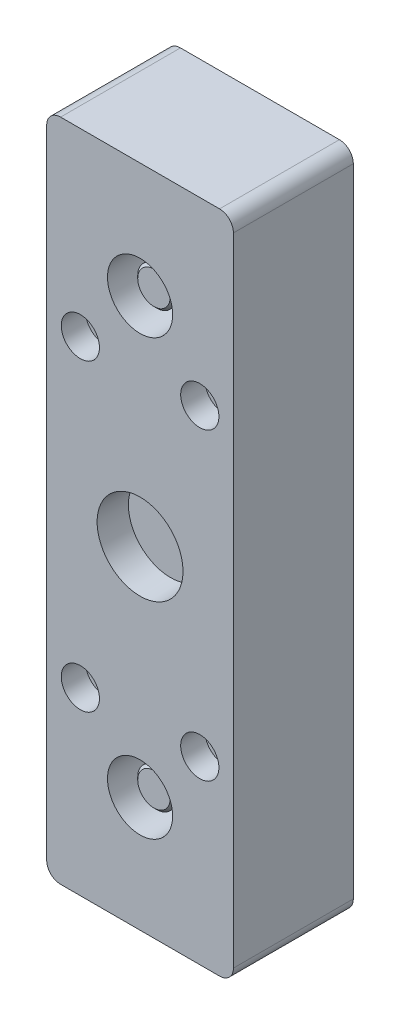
ISO-10303-21;
HEADER;
FILE_DESCRIPTION(('STEP AP214'),'2;1');
FILE_NAME('part.step','',(''),(''),'','','');
FILE_SCHEMA(('AUTOMOTIVE_DESIGN { 1 0 10303 214 1 1 1 1 }'));
ENDSEC;
DATA;
#1=APPLICATION_CONTEXT('core data for automotive mechanical design processes');
#2=APPLICATION_PROTOCOL_DEFINITION('international standard','automotive_design',2000,#1);
#3=PRODUCT_CONTEXT('',#1,'mechanical');
#4=PRODUCT('Part','Part','',(#3));
#5=PRODUCT_RELATED_PRODUCT_CATEGORY('part','',(#4));
#6=PRODUCT_DEFINITION_FORMATION('','',#4);
#7=PRODUCT_DEFINITION_CONTEXT('part definition',#1,'design');
#8=PRODUCT_DEFINITION('design','',#6,#7);
#9=PRODUCT_DEFINITION_SHAPE('','',#8);
#10=(LENGTH_UNIT() NAMED_UNIT(*) SI_UNIT(.MILLI.,.METRE.));
#11=(NAMED_UNIT(*) PLANE_ANGLE_UNIT() SI_UNIT($,.RADIAN.));
#12=(NAMED_UNIT(*) SI_UNIT($,.STERADIAN.) SOLID_ANGLE_UNIT());
#13=UNCERTAINTY_MEASURE_WITH_UNIT(LENGTH_MEASURE(1.E-05),#10,'distance_accuracy_value','');
#14=(GEOMETRIC_REPRESENTATION_CONTEXT(3) GLOBAL_UNCERTAINTY_ASSIGNED_CONTEXT((#13)) GLOBAL_UNIT_ASSIGNED_CONTEXT((#10,
#11,#12)) REPRESENTATION_CONTEXT('',''));
#15=CARTESIAN_POINT('',(0.,0.,0.));
#16=DIRECTION('',(0.,0.,1.));
#17=DIRECTION('',(1.,0.,0.));
#18=AXIS2_PLACEMENT_3D('',#15,#16,#17);
#19=CARTESIAN_POINT('',(1.73205080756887,66.5,-11.7715));
#20=DIRECTION('',(0.,0.,-1.));
#21=DIRECTION('',(-1.,0.,0.));
#22=AXIS2_PLACEMENT_3D('',#19,#20,#21);
#23=PLANE('',#22);
#24=DIRECTION('',(1.,0.,0.));
#25=VECTOR('',#24,1.);
#26=CARTESIAN_POINT('',(-1.73205080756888,66.5,-11.7715));
#27=LINE('',#26,#25);
#28=CARTESIAN_POINT('',(-1.73205080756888,66.5,-11.7715));
#29=VERTEX_POINT('',#28);
#30=CARTESIAN_POINT('',(1.73205080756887,66.5,-11.7715));
#31=VERTEX_POINT('',#30);
#32=EDGE_CURVE('E1108',#29,#31,#27,.T.);
#33=ORIENTED_EDGE('',*,*,#32,.T.);
#34=DIRECTION('',(0.5,-0.866025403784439,0.));
#35=VECTOR('',#34,1.);
#36=CARTESIAN_POINT('',(1.73205080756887,66.5,-11.7715));
#37=LINE('',#36,#35);
#38=CARTESIAN_POINT('',(3.46410161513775,63.5,-11.7715));
#39=VERTEX_POINT('',#38);
#40=EDGE_CURVE('E1112',#31,#39,#37,.T.);
#41=ORIENTED_EDGE('',*,*,#40,.T.);
#42=DIRECTION('',(-0.5,-0.866025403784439,0.));
#43=VECTOR('',#42,1.);
#44=CARTESIAN_POINT('',(3.46410161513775,63.5,-11.7715));
#45=LINE('',#44,#43);
#46=CARTESIAN_POINT('',(1.73205080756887,60.5,-11.7715));
#47=VERTEX_POINT('',#46);
#48=EDGE_CURVE('E1119',#39,#47,#45,.T.);
#49=ORIENTED_EDGE('',*,*,#48,.T.);
#50=DIRECTION('',(-1.,0.,0.));
#51=VECTOR('',#50,1.);
#52=CARTESIAN_POINT('',(1.73205080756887,60.5,-11.7715));
#53=LINE('',#52,#51);
#54=CARTESIAN_POINT('',(-1.73205080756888,60.5,-11.7715));
#55=VERTEX_POINT('',#54);
#56=EDGE_CURVE('E1126',#47,#55,#53,.T.);
#57=ORIENTED_EDGE('',*,*,#56,.T.);
#58=DIRECTION('',(-0.5,0.866025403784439,0.));
#59=VECTOR('',#58,1.);
#60=CARTESIAN_POINT('',(-1.73205080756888,60.5,-11.7715));
#61=LINE('',#60,#59);
#62=CARTESIAN_POINT('',(-3.46410161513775,63.5,-11.7715));
#63=VERTEX_POINT('',#62);
#64=EDGE_CURVE('E1129',#55,#63,#61,.T.);
#65=ORIENTED_EDGE('',*,*,#64,.T.);
#66=DIRECTION('',(0.5,0.866025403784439,0.));
#67=VECTOR('',#66,1.);
#68=CARTESIAN_POINT('',(-3.46410161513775,63.5,-11.7715));
#69=LINE('',#68,#67);
#70=EDGE_CURVE('E1115',#63,#29,#69,.T.);
#71=ORIENTED_EDGE('',*,*,#70,.T.);
#72=EDGE_LOOP('',(#33,#41,#49,#57,#65,#71));
#73=FACE_BOUND('',#72,.T.);
#74=ADVANCED_FACE('F16',(#73),#23,.T.);
#75=CARTESIAN_POINT('',(3.46410161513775,63.5,-11.7715));
#76=DIRECTION('',(0.866025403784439,-0.5,0.));
#77=DIRECTION('',(-0.5,-0.866025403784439,0.));
#78=AXIS2_PLACEMENT_3D('',#75,#76,#77);
#79=PLANE('',#78);
#80=DIRECTION('',(-0.5,-0.866025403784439,0.));
#81=VECTOR('',#80,1.);
#82=CARTESIAN_POINT('',(3.46410161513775,63.5,-16.534));
#83=LINE('',#82,#81);
#84=CARTESIAN_POINT('',(3.46410161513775,63.5,-16.534));
#85=VERTEX_POINT('',#84);
#86=CARTESIAN_POINT('',(1.73205080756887,60.5,-16.534));
#87=VERTEX_POINT('',#86);
#88=EDGE_CURVE('E1137',#85,#87,#83,.T.);
#89=ORIENTED_EDGE('',*,*,#88,.T.);
#90=DIRECTION('',(0.,0.,-1.));
#91=VECTOR('',#90,1.);
#92=CARTESIAN_POINT('',(1.73205080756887,60.5,-11.7715));
#93=LINE('',#92,#91);
#94=EDGE_CURVE('E1154',#47,#87,#93,.T.);
#95=ORIENTED_EDGE('',*,*,#94,.F.);
#96=ORIENTED_EDGE('',*,*,#48,.F.);
#97=DIRECTION('',(0.,0.,-1.));
#98=VECTOR('',#97,1.);
#99=CARTESIAN_POINT('',(3.46410161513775,63.5,-11.7715));
#100=LINE('',#99,#98);
#101=EDGE_CURVE('E1157',#39,#85,#100,.T.);
#102=ORIENTED_EDGE('',*,*,#101,.T.);
#103=EDGE_LOOP('',(#89,#95,#96,#102));
#104=FACE_BOUND('',#103,.T.);
#105=ADVANCED_FACE('F986',(#104),#79,.F.);
#106=CARTESIAN_POINT('',(1.73205080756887,60.5,-11.7715));
#107=DIRECTION('',(0.,-1.,0.));
#108=DIRECTION('',(-1.,0.,0.));
#109=AXIS2_PLACEMENT_3D('',#106,#107,#108);
#110=PLANE('',#109);
#111=DIRECTION('',(-1.,0.,0.));
#112=VECTOR('',#111,1.);
#113=CARTESIAN_POINT('',(1.73205080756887,60.5,-16.534));
#114=LINE('',#113,#112);
#115=CARTESIAN_POINT('',(-1.73205080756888,60.5,-16.534));
#116=VERTEX_POINT('',#115);
#117=EDGE_CURVE('E1140',#87,#116,#114,.T.);
#118=ORIENTED_EDGE('',*,*,#117,.T.);
#119=DIRECTION('',(0.,0.,-1.));
#120=VECTOR('',#119,1.);
#121=CARTESIAN_POINT('',(-1.73205080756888,60.5,-11.7715));
#122=LINE('',#121,#120);
#123=EDGE_CURVE('E1151',#55,#116,#122,.T.);
#124=ORIENTED_EDGE('',*,*,#123,.F.);
#125=ORIENTED_EDGE('',*,*,#56,.F.);
#126=ORIENTED_EDGE('',*,*,#94,.T.);
#127=EDGE_LOOP('',(#118,#124,#125,#126));
#128=FACE_BOUND('',#127,.T.);
#129=ADVANCED_FACE('F975',(#128),#110,.F.);
#130=CARTESIAN_POINT('',(-1.73205080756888,60.5,-11.7715));
#131=DIRECTION('',(-0.866025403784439,-0.5,0.));
#132=DIRECTION('',(-0.5,0.866025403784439,0.));
#133=AXIS2_PLACEMENT_3D('',#130,#131,#132);
#134=PLANE('',#133);
#135=DIRECTION('',(-0.5,0.866025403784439,0.));
#136=VECTOR('',#135,1.);
#137=CARTESIAN_POINT('',(-1.73205080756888,60.5,-16.534));
#138=LINE('',#137,#136);
#139=CARTESIAN_POINT('',(-3.46410161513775,63.5,-16.534));
#140=VERTEX_POINT('',#139);
#141=EDGE_CURVE('E1122',#116,#140,#138,.T.);
#142=ORIENTED_EDGE('',*,*,#141,.T.);
#143=DIRECTION('',(0.,0.,-1.));
#144=VECTOR('',#143,1.);
#145=CARTESIAN_POINT('',(-3.46410161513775,63.5,-11.7715));
#146=LINE('',#145,#144);
#147=EDGE_CURVE('E1148',#63,#140,#146,.T.);
#148=ORIENTED_EDGE('',*,*,#147,.F.);
#149=ORIENTED_EDGE('',*,*,#64,.F.);
#150=ORIENTED_EDGE('',*,*,#123,.T.);
#151=EDGE_LOOP('',(#142,#148,#149,#150));
#152=FACE_BOUND('',#151,.T.);
#153=ADVANCED_FACE('F964',(#152),#134,.F.);
#154=CARTESIAN_POINT('',(-3.46410161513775,63.5,-11.7715));
#155=DIRECTION('',(-0.866025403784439,0.5,0.));
#156=DIRECTION('',(0.5,0.866025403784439,0.));
#157=AXIS2_PLACEMENT_3D('',#154,#155,#156);
#158=PLANE('',#157);
#159=DIRECTION('',(0.5,0.866025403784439,0.));
#160=VECTOR('',#159,1.);
#161=CARTESIAN_POINT('',(-3.46410161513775,63.5,-16.534));
#162=LINE('',#161,#160);
#163=CARTESIAN_POINT('',(-1.73205080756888,66.5,-16.534));
#164=VERTEX_POINT('',#163);
#165=EDGE_CURVE('E1117',#140,#164,#162,.T.);
#166=ORIENTED_EDGE('',*,*,#165,.T.);
#167=DIRECTION('',(0.,0.,-1.));
#168=VECTOR('',#167,1.);
#169=CARTESIAN_POINT('',(-1.73205080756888,66.5,-11.7715));
#170=LINE('',#169,#168);
#171=EDGE_CURVE('E1145',#29,#164,#170,.T.);
#172=ORIENTED_EDGE('',*,*,#171,.F.);
#173=ORIENTED_EDGE('',*,*,#70,.F.);
#174=ORIENTED_EDGE('',*,*,#147,.T.);
#175=EDGE_LOOP('',(#166,#172,#173,#174));
#176=FACE_BOUND('',#175,.T.);
#177=ADVANCED_FACE('F954',(#176),#158,.F.);
#178=CARTESIAN_POINT('',(-1.73205080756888,66.5,-11.7715));
#179=DIRECTION('',(0.,1.,0.));
#180=DIRECTION('',(1.,0.,0.));
#181=AXIS2_PLACEMENT_3D('',#178,#179,#180);
#182=PLANE('',#181);
#183=DIRECTION('',(1.,0.,0.));
#184=VECTOR('',#183,1.);
#185=CARTESIAN_POINT('',(-1.73205080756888,66.5,-16.534));
#186=LINE('',#185,#184);
#187=CARTESIAN_POINT('',(1.73205080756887,66.5,-16.534));
#188=VERTEX_POINT('',#187);
#189=EDGE_CURVE('E35',#164,#188,#186,.T.);
#190=ORIENTED_EDGE('',*,*,#189,.T.);
#191=DIRECTION('',(0.,0.,-1.));
#192=VECTOR('',#191,1.);
#193=CARTESIAN_POINT('',(1.73205080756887,66.5,-11.7715));
#194=LINE('',#193,#192);
#195=EDGE_CURVE('E1132',#31,#188,#194,.T.);
#196=ORIENTED_EDGE('',*,*,#195,.F.);
#197=ORIENTED_EDGE('',*,*,#32,.F.);
#198=ORIENTED_EDGE('',*,*,#171,.T.);
#199=EDGE_LOOP('',(#190,#196,#197,#198));
#200=FACE_BOUND('',#199,.T.);
#201=ADVANCED_FACE('F943',(#200),#182,.F.);
#202=CARTESIAN_POINT('',(1.73205080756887,66.5,-11.7715));
#203=DIRECTION('',(0.866025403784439,0.5,0.));
#204=DIRECTION('',(0.5,-0.866025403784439,0.));
#205=AXIS2_PLACEMENT_3D('',#202,#203,#204);
#206=PLANE('',#205);
#207=DIRECTION('',(0.5,-0.866025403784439,0.));
#208=VECTOR('',#207,1.);
#209=CARTESIAN_POINT('',(1.73205080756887,66.5,-16.534));
#210=LINE('',#209,#208);
#211=EDGE_CURVE('E1134',#188,#85,#210,.T.);
#212=ORIENTED_EDGE('',*,*,#211,.T.);
#213=ORIENTED_EDGE('',*,*,#101,.F.);
#214=ORIENTED_EDGE('',*,*,#40,.F.);
#215=ORIENTED_EDGE('',*,*,#195,.T.);
#216=EDGE_LOOP('',(#212,#213,#214,#215));
#217=FACE_BOUND('',#216,.T.);
#218=ADVANCED_FACE('F932',(#217),#206,.F.);
#219=CARTESIAN_POINT('',(0.,63.5,-16.534));
#220=DIRECTION('',(0.,0.,1.));
#221=DIRECTION('',(1.,0.,0.));
#222=AXIS2_PLACEMENT_3D('',#219,#220,#221);
#223=PLANE('',#222);
#224=ORIENTED_EDGE('',*,*,#211,.F.);
#225=ORIENTED_EDGE('',*,*,#189,.F.);
#226=ORIENTED_EDGE('',*,*,#165,.F.);
#227=ORIENTED_EDGE('',*,*,#141,.F.);
#228=ORIENTED_EDGE('',*,*,#117,.F.);
#229=ORIENTED_EDGE('',*,*,#88,.F.);
#230=EDGE_LOOP('',(#224,#225,#226,#227,#228,#229));
#231=FACE_BOUND('',#230,.T.);
#232=CARTESIAN_POINT('',(0.,63.5,-16.534));
#233=DIRECTION('',(0.,0.,1.));
#234=DIRECTION('',(1.,0.,0.));
#235=AXIS2_PLACEMENT_3D('',#232,#233,#234);
#236=CIRCLE('',#235,11.2);
#237=CARTESIAN_POINT('',(11.2,63.5,-16.534));
#238=VERTEX_POINT('',#237);
#239=EDGE_CURVE('E1147',#238,#238,#236,.T.);
#240=ORIENTED_EDGE('',*,*,#239,.F.);
#241=EDGE_LOOP('',(#240));
#242=FACE_BOUND('',#241,.T.);
#243=ADVANCED_FACE('F392',(#231,#242),#223,.F.);
#244=CARTESIAN_POINT('',(0.,63.5,61.5607119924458));
#245=DIRECTION('',(0.,0.,1.));
#246=DIRECTION('',(1.,0.,0.));
#247=AXIS2_PLACEMENT_3D('',#244,#245,#246);
#248=CYLINDRICAL_SURFACE('',#247,11.2);
#249=CARTESIAN_POINT('',(0.,63.5,-16.026));
#250=DIRECTION('',(0.,0.,1.));
#251=DIRECTION('',(1.,0.,0.));
#252=AXIS2_PLACEMENT_3D('',#249,#250,#251);
#253=CIRCLE('',#252,11.2);
#254=CARTESIAN_POINT('',(11.2,63.5,-16.026));
#255=VERTEX_POINT('',#254);
#256=EDGE_CURVE('E1163',#255,#255,#253,.T.);
#257=ORIENTED_EDGE('',*,*,#256,.F.);
#258=EDGE_LOOP('',(#257));
#259=FACE_BOUND('',#258,.T.);
#260=ORIENTED_EDGE('',*,*,#239,.T.);
#261=EDGE_LOOP('',(#260));
#262=FACE_BOUND('',#261,.T.);
#263=ADVANCED_FACE('F384',(#259,#262),#248,.T.);
#264=CARTESIAN_POINT('',(0.,-57.992,13.466));
#265=DIRECTION('',(0.,0.,-1.));
#266=DIRECTION('',(-1.,0.,0.));
#267=AXIS2_PLACEMENT_3D('',#264,#265,#266);
#268=PLANE('',#267);
#269=CARTESIAN_POINT('',(0.,-63.5,13.466));
#270=DIRECTION('',(0.,0.,-1.));
#271=DIRECTION('',(-1.,0.,0.));
#272=AXIS2_PLACEMENT_3D('',#269,#270,#271);
#273=CIRCLE('',#272,4.746);
#274=CARTESIAN_POINT('',(-4.74599999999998,-63.5,13.466));
#275=VERTEX_POINT('',#274);
#276=EDGE_CURVE('E179',#275,#275,#273,.F.);
#277=ORIENTED_EDGE('',*,*,#276,.T.);
#278=EDGE_LOOP('',(#277));
#279=FACE_BOUND('',#278,.T.);
#280=ADVANCED_FACE('F382',(#279),#268,.F.);
#281=CARTESIAN_POINT('',(0.,-63.5,13.466));
#282=DIRECTION('',(0.,0.,-1.));
#283=DIRECTION('',(-1.,0.,0.));
#284=AXIS2_PLACEMENT_3D('',#281,#282,#283);
#285=CONICAL_SURFACE('',#284,4.746,0.785398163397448);
#286=CARTESIAN_POINT('',(0.,-63.5,12.704));
#287=DIRECTION('',(0.,0.,-1.));
#288=DIRECTION('',(-1.,0.,0.));
#289=AXIS2_PLACEMENT_3D('',#286,#287,#288);
#290=CIRCLE('',#289,5.508);
#291=CARTESIAN_POINT('',(-5.50799999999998,-63.5,12.704));
#292=VERTEX_POINT('',#291);
#293=EDGE_CURVE('E181',#292,#292,#290,.T.);
#294=ORIENTED_EDGE('',*,*,#293,.F.);
#295=EDGE_LOOP('',(#294));
#296=FACE_BOUND('',#295,.T.);
#297=ORIENTED_EDGE('',*,*,#276,.F.);
#298=EDGE_LOOP('',(#297));
#299=FACE_BOUND('',#298,.T.);
#300=ADVANCED_FACE('F18',(#296,#299),#285,.T.);
#301=CARTESIAN_POINT('',(1.73205080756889,-60.5,-11.7715));
#302=DIRECTION('',(0.,0.,-1.));
#303=DIRECTION('',(-1.,0.,0.));
#304=AXIS2_PLACEMENT_3D('',#301,#302,#303);
#305=PLANE('',#304);
#306=DIRECTION('',(1.,0.,0.));
#307=VECTOR('',#306,1.);
#308=CARTESIAN_POINT('',(-1.73205080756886,-60.5,-11.7715));
#309=LINE('',#308,#307);
#310=CARTESIAN_POINT('',(-1.73205080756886,-60.5,-11.7715));
#311=VERTEX_POINT('',#310);
#312=CARTESIAN_POINT('',(1.73205080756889,-60.5,-11.7715));
#313=VERTEX_POINT('',#312);
#314=EDGE_CURVE('E134',#311,#313,#309,.T.);
#315=ORIENTED_EDGE('',*,*,#314,.T.);
#316=DIRECTION('',(0.5,-0.866025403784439,0.));
#317=VECTOR('',#316,1.);
#318=CARTESIAN_POINT('',(1.73205080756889,-60.5,-11.7715));
#319=LINE('',#318,#317);
#320=CARTESIAN_POINT('',(3.46410161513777,-63.5,-11.7715));
#321=VERTEX_POINT('',#320);
#322=EDGE_CURVE('E347',#313,#321,#319,.T.);
#323=ORIENTED_EDGE('',*,*,#322,.T.);
#324=DIRECTION('',(-0.5,-0.866025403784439,0.));
#325=VECTOR('',#324,1.);
#326=CARTESIAN_POINT('',(3.46410161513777,-63.5,-11.7715));
#327=LINE('',#326,#325);
#328=CARTESIAN_POINT('',(1.73205080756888,-66.5,-11.7715));
#329=VERTEX_POINT('',#328);
#330=EDGE_CURVE('E350',#321,#329,#327,.T.);
#331=ORIENTED_EDGE('',*,*,#330,.T.);
#332=DIRECTION('',(-1.,0.,0.));
#333=VECTOR('',#332,1.);
#334=CARTESIAN_POINT('',(1.73205080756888,-66.5,-11.7715));
#335=LINE('',#334,#333);
#336=CARTESIAN_POINT('',(-1.73205080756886,-66.5,-11.7715));
#337=VERTEX_POINT('',#336);
#338=EDGE_CURVE('E353',#329,#337,#335,.T.);
#339=ORIENTED_EDGE('',*,*,#338,.T.);
#340=DIRECTION('',(-0.5,0.866025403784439,0.));
#341=VECTOR('',#340,1.);
#342=CARTESIAN_POINT('',(-1.73205080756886,-66.5,-11.7715));
#343=LINE('',#342,#341);
#344=CARTESIAN_POINT('',(-3.46410161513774,-63.5,-11.7715));
#345=VERTEX_POINT('',#344);
#346=EDGE_CURVE('E355',#337,#345,#343,.T.);
#347=ORIENTED_EDGE('',*,*,#346,.T.);
#348=DIRECTION('',(0.5,0.866025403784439,0.));
#349=VECTOR('',#348,1.);
#350=CARTESIAN_POINT('',(-3.46410161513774,-63.5,-11.7715));
#351=LINE('',#350,#349);
#352=EDGE_CURVE('E159',#345,#311,#351,.T.);
#353=ORIENTED_EDGE('',*,*,#352,.T.);
#354=EDGE_LOOP('',(#315,#323,#331,#339,#347,#353));
#355=FACE_BOUND('',#354,.T.);
#356=ADVANCED_FACE('F359',(#355),#305,.T.);
#357=CARTESIAN_POINT('',(0.,-63.5,61.5607119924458));
#358=DIRECTION('',(0.,0.,1.));
#359=DIRECTION('',(1.,0.,0.));
#360=AXIS2_PLACEMENT_3D('',#357,#358,#359);
#361=CYLINDRICAL_SURFACE('',#360,5.508);
#362=CARTESIAN_POINT('',(0.,-63.5,-3.1242));
#363=DIRECTION('',(0.,0.,1.));
#364=DIRECTION('',(1.,0.,0.));
#365=AXIS2_PLACEMENT_3D('',#362,#363,#364);
#366=CIRCLE('',#365,5.508);
#367=CARTESIAN_POINT('',(5.50800000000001,-63.5,-3.1242));
#368=VERTEX_POINT('',#367);
#369=EDGE_CURVE('E20',#368,#368,#366,.F.);
#370=ORIENTED_EDGE('',*,*,#369,.F.);
#371=EDGE_LOOP('',(#370));
#372=FACE_BOUND('',#371,.T.);
#373=ORIENTED_EDGE('',*,*,#293,.T.);
#374=EDGE_LOOP('',(#373));
#375=FACE_BOUND('',#374,.T.);
#376=ADVANCED_FACE('F397',(#372,#375),#361,.T.);
#377=CARTESIAN_POINT('',(3.46410161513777,-63.5,-11.7715));
#378=DIRECTION('',(0.866025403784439,-0.5,0.));
#379=DIRECTION('',(-0.5,-0.866025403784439,0.));
#380=AXIS2_PLACEMENT_3D('',#377,#378,#379);
#381=PLANE('',#380);
#382=DIRECTION('',(-0.5,-0.866025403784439,0.));
#383=VECTOR('',#382,1.);
#384=CARTESIAN_POINT('',(3.46410161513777,-63.5,-16.534));
#385=LINE('',#384,#383);
#386=CARTESIAN_POINT('',(3.46410161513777,-63.5,-16.534));
#387=VERTEX_POINT('',#386);
#388=CARTESIAN_POINT('',(1.73205080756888,-66.5,-16.534));
#389=VERTEX_POINT('',#388);
#390=EDGE_CURVE('E156',#387,#389,#385,.T.);
#391=ORIENTED_EDGE('',*,*,#390,.T.);
#392=DIRECTION('',(0.,0.,-1.));
#393=VECTOR('',#392,1.);
#394=CARTESIAN_POINT('',(1.73205080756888,-66.5,-11.7715));
#395=LINE('',#394,#393);
#396=EDGE_CURVE('E171',#329,#389,#395,.T.);
#397=ORIENTED_EDGE('',*,*,#396,.F.);
#398=ORIENTED_EDGE('',*,*,#330,.F.);
#399=DIRECTION('',(0.,0.,-1.));
#400=VECTOR('',#399,1.);
#401=CARTESIAN_POINT('',(3.46410161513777,-63.5,-11.7715));
#402=LINE('',#401,#400);
#403=EDGE_CURVE('E173',#321,#387,#402,.T.);
#404=ORIENTED_EDGE('',*,*,#403,.T.);
#405=EDGE_LOOP('',(#391,#397,#398,#404));
#406=FACE_BOUND('',#405,.T.);
#407=ADVANCED_FACE('F365',(#406),#381,.F.);
#408=CARTESIAN_POINT('',(1.73205080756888,-66.5,-11.7715));
#409=DIRECTION('',(0.,-1.,0.));
#410=DIRECTION('',(-1.,0.,0.));
#411=AXIS2_PLACEMENT_3D('',#408,#409,#410);
#412=PLANE('',#411);
#413=DIRECTION('',(-1.,0.,0.));
#414=VECTOR('',#413,1.);
#415=CARTESIAN_POINT('',(1.73205080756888,-66.5,-16.534));
#416=LINE('',#415,#414);
#417=CARTESIAN_POINT('',(-1.73205080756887,-66.5,-16.534));
#418=VERTEX_POINT('',#417);
#419=EDGE_CURVE('E164',#389,#418,#416,.T.);
#420=ORIENTED_EDGE('',*,*,#419,.T.);
#421=DIRECTION('',(0.,0.,-1.));
#422=VECTOR('',#421,1.);
#423=CARTESIAN_POINT('',(-1.73205080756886,-66.5,-11.7715));
#424=LINE('',#423,#422);
#425=EDGE_CURVE('E169',#337,#418,#424,.T.);
#426=ORIENTED_EDGE('',*,*,#425,.F.);
#427=ORIENTED_EDGE('',*,*,#338,.F.);
#428=ORIENTED_EDGE('',*,*,#396,.T.);
#429=EDGE_LOOP('',(#420,#426,#427,#428));
#430=FACE_BOUND('',#429,.T.);
#431=ADVANCED_FACE('F369',(#430),#412,.F.);
#432=CARTESIAN_POINT('',(-1.73205080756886,-66.5,-11.7715));
#433=DIRECTION('',(-0.866025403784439,-0.5,0.));
#434=DIRECTION('',(-0.5,0.866025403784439,0.));
#435=AXIS2_PLACEMENT_3D('',#432,#433,#434);
#436=PLANE('',#435);
#437=DIRECTION('',(-0.5,0.866025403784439,0.));
#438=VECTOR('',#437,1.);
#439=CARTESIAN_POINT('',(-1.73205080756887,-66.5,-16.534));
#440=LINE('',#439,#438);
#441=CARTESIAN_POINT('',(-3.46410161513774,-63.5,-16.534));
#442=VERTEX_POINT('',#441);
#443=EDGE_CURVE('E147',#418,#442,#440,.T.);
#444=ORIENTED_EDGE('',*,*,#443,.T.);
#445=DIRECTION('',(0.,0.,-1.));
#446=VECTOR('',#445,1.);
#447=CARTESIAN_POINT('',(-3.46410161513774,-63.5,-11.7715));
#448=LINE('',#447,#446);
#449=EDGE_CURVE('E139',#345,#442,#448,.T.);
#450=ORIENTED_EDGE('',*,*,#449,.F.);
#451=ORIENTED_EDGE('',*,*,#346,.F.);
#452=ORIENTED_EDGE('',*,*,#425,.T.);
#453=EDGE_LOOP('',(#444,#450,#451,#452));
#454=FACE_BOUND('',#453,.T.);
#455=ADVANCED_FACE('F371',(#454),#436,.F.);
#456=CARTESIAN_POINT('',(-3.46410161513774,-63.5,-11.7715));
#457=DIRECTION('',(-0.866025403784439,0.5,0.));
#458=DIRECTION('',(0.5,0.866025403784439,0.));
#459=AXIS2_PLACEMENT_3D('',#456,#457,#458);
#460=PLANE('',#459);
#461=DIRECTION('',(0.5,0.866025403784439,0.));
#462=VECTOR('',#461,1.);
#463=CARTESIAN_POINT('',(-3.46410161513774,-63.5,-16.534));
#464=LINE('',#463,#462);
#465=CARTESIAN_POINT('',(-1.73205080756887,-60.5,-16.534));
#466=VERTEX_POINT('',#465);
#467=EDGE_CURVE('E142',#442,#466,#464,.T.);
#468=ORIENTED_EDGE('',*,*,#467,.T.);
#469=DIRECTION('',(0.,0.,-1.));
#470=VECTOR('',#469,1.);
#471=CARTESIAN_POINT('',(-1.73205080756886,-60.5,-11.7715));
#472=LINE('',#471,#470);
#473=EDGE_CURVE('E127',#311,#466,#472,.T.);
#474=ORIENTED_EDGE('',*,*,#473,.F.);
#475=ORIENTED_EDGE('',*,*,#352,.F.);
#476=ORIENTED_EDGE('',*,*,#449,.T.);
#477=EDGE_LOOP('',(#468,#474,#475,#476));
#478=FACE_BOUND('',#477,.T.);
#479=ADVANCED_FACE('F143',(#478),#460,.F.);
#480=CARTESIAN_POINT('',(-1.73205080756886,-60.5,-11.7715));
#481=DIRECTION('',(0.,1.,0.));
#482=DIRECTION('',(1.,0.,0.));
#483=AXIS2_PLACEMENT_3D('',#480,#481,#482);
#484=PLANE('',#483);
#485=DIRECTION('',(1.,0.,0.));
#486=VECTOR('',#485,1.);
#487=CARTESIAN_POINT('',(-1.73205080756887,-60.5,-16.534));
#488=LINE('',#487,#486);
#489=CARTESIAN_POINT('',(1.73205080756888,-60.5,-16.534));
#490=VERTEX_POINT('',#489);
#491=EDGE_CURVE('E131',#466,#490,#488,.T.);
#492=ORIENTED_EDGE('',*,*,#491,.T.);
#493=DIRECTION('',(0.,0.,-1.));
#494=VECTOR('',#493,1.);
#495=CARTESIAN_POINT('',(1.73205080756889,-60.5,-11.7715));
#496=LINE('',#495,#494);
#497=EDGE_CURVE('E175',#313,#490,#496,.T.);
#498=ORIENTED_EDGE('',*,*,#497,.F.);
#499=ORIENTED_EDGE('',*,*,#314,.F.);
#500=ORIENTED_EDGE('',*,*,#473,.T.);
#501=EDGE_LOOP('',(#492,#498,#499,#500));
#502=FACE_BOUND('',#501,.T.);
#503=ADVANCED_FACE('F129',(#502),#484,.F.);
#504=CARTESIAN_POINT('',(1.73205080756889,-60.5,-11.7715));
#505=DIRECTION('',(0.866025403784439,0.5,0.));
#506=DIRECTION('',(0.5,-0.866025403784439,0.));
#507=AXIS2_PLACEMENT_3D('',#504,#505,#506);
#508=PLANE('',#507);
#509=DIRECTION('',(0.5,-0.866025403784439,0.));
#510=VECTOR('',#509,1.);
#511=CARTESIAN_POINT('',(1.73205080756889,-60.5,-16.534));
#512=LINE('',#511,#510);
#513=EDGE_CURVE('E154',#490,#387,#512,.T.);
#514=ORIENTED_EDGE('',*,*,#513,.T.);
#515=ORIENTED_EDGE('',*,*,#403,.F.);
#516=ORIENTED_EDGE('',*,*,#322,.F.);
#517=ORIENTED_EDGE('',*,*,#497,.T.);
#518=EDGE_LOOP('',(#514,#515,#516,#517));
#519=FACE_BOUND('',#518,.T.);
#520=ADVANCED_FACE('F363',(#519),#508,.F.);
#521=CARTESIAN_POINT('',(17.4625,-44.45,10.414));
#522=DIRECTION('',(0.,0.,1.));
#523=DIRECTION('',(1.,0.,0.));
#524=AXIS2_PLACEMENT_3D('',#521,#522,#523);
#525=PLANE('',#524);
#526=CARTESIAN_POINT('',(17.4625,-44.45,10.414));
#527=DIRECTION('',(0.,0.,1.));
#528=DIRECTION('',(1.,0.,0.));
#529=AXIS2_PLACEMENT_3D('',#526,#527,#528);
#530=CIRCLE('',#529,3.4);
#531=CARTESIAN_POINT('',(20.8625,-44.45,10.414));
#532=VERTEX_POINT('',#531);
#533=EDGE_CURVE('E334',#532,#532,#530,.T.);
#534=ORIENTED_EDGE('',*,*,#533,.F.);
#535=EDGE_LOOP('',(#534));
#536=FACE_BOUND('',#535,.T.);
#537=CARTESIAN_POINT('',(17.4625,-44.45,10.414));
#538=DIRECTION('',(0.,0.,1.));
#539=DIRECTION('',(1.,0.,0.));
#540=AXIS2_PLACEMENT_3D('',#537,#538,#539);
#541=CIRCLE('',#540,5.588);
#542=CARTESIAN_POINT('',(23.0505,-44.45,10.414));
#543=VERTEX_POINT('',#542);
#544=EDGE_CURVE('E331',#543,#543,#541,.T.);
#545=ORIENTED_EDGE('',*,*,#544,.T.);
#546=EDGE_LOOP('',(#545));
#547=FACE_BOUND('',#546,.T.);
#548=ADVANCED_FACE('F415',(#536,#547),#525,.T.);
#549=CARTESIAN_POINT('',(17.4625,44.45,10.414));
#550=DIRECTION('',(0.,0.,1.));
#551=DIRECTION('',(1.,0.,0.));
#552=AXIS2_PLACEMENT_3D('',#549,#550,#551);
#553=PLANE('',#552);
#554=CARTESIAN_POINT('',(17.4625,44.45,10.414));
#555=DIRECTION('',(0.,0.,1.));
#556=DIRECTION('',(1.,0.,0.));
#557=AXIS2_PLACEMENT_3D('',#554,#555,#556);
#558=CIRCLE('',#557,3.4);
#559=CARTESIAN_POINT('',(20.8625,44.45,10.414));
#560=VERTEX_POINT('',#559);
#561=EDGE_CURVE('E316',#560,#560,#558,.T.);
#562=ORIENTED_EDGE('',*,*,#561,.F.);
#563=EDGE_LOOP('',(#562));
#564=FACE_BOUND('',#563,.T.);
#565=CARTESIAN_POINT('',(17.4625,44.45,10.414));
#566=DIRECTION('',(0.,0.,1.));
#567=DIRECTION('',(1.,0.,0.));
#568=AXIS2_PLACEMENT_3D('',#565,#566,#567);
#569=CIRCLE('',#568,5.588);
#570=CARTESIAN_POINT('',(23.0505,44.45,10.414));
#571=VERTEX_POINT('',#570);
#572=EDGE_CURVE('E313',#571,#571,#569,.T.);
#573=ORIENTED_EDGE('',*,*,#572,.T.);
#574=EDGE_LOOP('',(#573));
#575=FACE_BOUND('',#574,.T.);
#576=ADVANCED_FACE('F510',(#564,#575),#553,.T.);
#577=CARTESIAN_POINT('',(-17.4625,44.45,10.414));
#578=DIRECTION('',(0.,0.,1.));
#579=DIRECTION('',(1.,0.,0.));
#580=AXIS2_PLACEMENT_3D('',#577,#578,#579);
#581=PLANE('',#580);
#582=CARTESIAN_POINT('',(-17.4625,44.45,10.414));
#583=DIRECTION('',(0.,0.,1.));
#584=DIRECTION('',(1.,0.,0.));
#585=AXIS2_PLACEMENT_3D('',#582,#583,#584);
#586=CIRCLE('',#585,3.4);
#587=CARTESIAN_POINT('',(-14.0625,44.45,10.414));
#588=VERTEX_POINT('',#587);
#589=EDGE_CURVE('E235',#588,#588,#586,.T.);
#590=ORIENTED_EDGE('',*,*,#589,.F.);
#591=EDGE_LOOP('',(#590));
#592=FACE_BOUND('',#591,.T.);
#593=CARTESIAN_POINT('',(-17.4625,44.45,10.414));
#594=DIRECTION('',(0.,0.,1.));
#595=DIRECTION('',(1.,0.,0.));
#596=AXIS2_PLACEMENT_3D('',#593,#594,#595);
#597=CIRCLE('',#596,5.588);
#598=CARTESIAN_POINT('',(-11.8745,44.45,10.414));
#599=VERTEX_POINT('',#598);
#600=EDGE_CURVE('E239',#599,#599,#597,.T.);
#601=ORIENTED_EDGE('',*,*,#600,.T.);
#602=EDGE_LOOP('',(#601));
#603=FACE_BOUND('',#602,.T.);
#604=ADVANCED_FACE('F518',(#592,#603),#581,.T.);
#605=CARTESIAN_POINT('',(-17.4625,-44.45,10.414));
#606=DIRECTION('',(0.,0.,1.));
#607=DIRECTION('',(1.,0.,0.));
#608=AXIS2_PLACEMENT_3D('',#605,#606,#607);
#609=PLANE('',#608);
#610=CARTESIAN_POINT('',(-17.4625,-44.45,10.414));
#611=DIRECTION('',(0.,0.,1.));
#612=DIRECTION('',(1.,0.,0.));
#613=AXIS2_PLACEMENT_3D('',#610,#611,#612);
#614=CIRCLE('',#613,3.4);
#615=CARTESIAN_POINT('',(-14.0625,-44.45,10.414));
#616=VERTEX_POINT('',#615);
#617=EDGE_CURVE('E222',#616,#616,#614,.T.);
#618=ORIENTED_EDGE('',*,*,#617,.F.);
#619=EDGE_LOOP('',(#618));
#620=FACE_BOUND('',#619,.T.);
#621=CARTESIAN_POINT('',(-17.4625,-44.45,10.414));
#622=DIRECTION('',(0.,0.,1.));
#623=DIRECTION('',(1.,0.,0.));
#624=AXIS2_PLACEMENT_3D('',#621,#622,#623);
#625=CIRCLE('',#624,5.588);
#626=CARTESIAN_POINT('',(-11.8745,-44.45,10.414));
#627=VERTEX_POINT('',#626);
#628=EDGE_CURVE('E225',#627,#627,#625,.T.);
#629=ORIENTED_EDGE('',*,*,#628,.T.);
#630=EDGE_LOOP('',(#629));
#631=FACE_BOUND('',#630,.T.);
#632=ADVANCED_FACE('F527',(#620,#631),#609,.T.);
#633=CARTESIAN_POINT('',(0.,-63.5,-3.1242));
#634=DIRECTION('',(0.,0.,1.));
#635=DIRECTION('',(1.,0.,0.));
#636=AXIS2_PLACEMENT_3D('',#633,#634,#635);
#637=PLANE('',#636);
#638=ORIENTED_EDGE('',*,*,#369,.T.);
#639=EDGE_LOOP('',(#638));
#640=FACE_BOUND('',#639,.T.);
#641=CARTESIAN_POINT('',(0.,-63.5,-3.1242));
#642=DIRECTION('',(0.,0.,1.));
#643=DIRECTION('',(1.,0.,0.));
#644=AXIS2_PLACEMENT_3D('',#641,#642,#643);
#645=CIRCLE('',#644,9.525);
#646=CARTESIAN_POINT('',(9.525,-63.5,-3.1242));
#647=VERTEX_POINT('',#646);
#648=EDGE_CURVE('E199',#647,#647,#645,.T.);
#649=ORIENTED_EDGE('',*,*,#648,.T.);
#650=EDGE_LOOP('',(#649));
#651=FACE_BOUND('',#650,.T.);
#652=ADVANCED_FACE('F536',(#640,#651),#637,.T.);
#653=CARTESIAN_POINT('',(-23.241,93.091,8.636));
#654=DIRECTION('',(0.,0.,-1.));
#655=DIRECTION('',(-1.,0.,0.));
#656=AXIS2_PLACEMENT_3D('',#653,#654,#655);
#657=PLANE('',#656);
#658=CARTESIAN_POINT('',(0.,0.,8.636));
#659=DIRECTION('',(0.,0.,-1.));
#660=DIRECTION('',(-1.,0.,0.));
#661=AXIS2_PLACEMENT_3D('',#658,#659,#660);
#662=CIRCLE('',#661,12.292470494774);
#663=CARTESIAN_POINT('',(-12.292470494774,0.,8.636));
#664=VERTEX_POINT('',#663);
#665=EDGE_CURVE('E340',#664,#664,#662,.F.);
#666=ORIENTED_EDGE('',*,*,#665,.T.);
#667=EDGE_LOOP('',(#666));
#668=FACE_BOUND('',#667,.T.);
#669=ADVANCED_FACE('F545',(#668),#657,.F.);
#670=CARTESIAN_POINT('',(17.4625,-44.45,10.414));
#671=DIRECTION('',(0.,0.,1.));
#672=DIRECTION('',(1.,0.,0.));
#673=AXIS2_PLACEMENT_3D('',#670,#671,#672);
#674=CYLINDRICAL_SURFACE('',#673,3.4);
#675=CARTESIAN_POINT('',(17.4625,-44.45,-9.3359986));
#676=DIRECTION('',(0.,0.,1.));
#677=DIRECTION('',(1.,0.,0.));
#678=AXIS2_PLACEMENT_3D('',#675,#676,#677);
#679=CIRCLE('',#678,3.4);
#680=CARTESIAN_POINT('',(20.8625,-44.45,-9.3359986));
#681=VERTEX_POINT('',#680);
#682=EDGE_CURVE('E337',#681,#681,#679,.T.);
#683=ORIENTED_EDGE('',*,*,#682,.F.);
#684=EDGE_LOOP('',(#683));
#685=FACE_BOUND('',#684,.T.);
#686=ORIENTED_EDGE('',*,*,#533,.T.);
#687=EDGE_LOOP('',(#686));
#688=FACE_BOUND('',#687,.T.);
#689=ADVANCED_FACE('F554',(#685,#688),#674,.F.);
#690=CARTESIAN_POINT('',(17.4625,44.45,10.414));
#691=DIRECTION('',(0.,0.,1.));
#692=DIRECTION('',(1.,0.,0.));
#693=AXIS2_PLACEMENT_3D('',#690,#691,#692);
#694=CYLINDRICAL_SURFACE('',#693,3.4);
#695=CARTESIAN_POINT('',(17.4625,44.45,-9.3359986));
#696=DIRECTION('',(0.,0.,1.));
#697=DIRECTION('',(1.,0.,0.));
#698=AXIS2_PLACEMENT_3D('',#695,#696,#697);
#699=CIRCLE('',#698,3.4);
#700=CARTESIAN_POINT('',(20.8625,44.45,-9.3359986));
#701=VERTEX_POINT('',#700);
#702=EDGE_CURVE('E319',#701,#701,#699,.T.);
#703=ORIENTED_EDGE('',*,*,#702,.F.);
#704=EDGE_LOOP('',(#703));
#705=FACE_BOUND('',#704,.T.);
#706=ORIENTED_EDGE('',*,*,#561,.T.);
#707=EDGE_LOOP('',(#706));
#708=FACE_BOUND('',#707,.T.);
#709=ADVANCED_FACE('F563',(#705,#708),#694,.F.);
#710=CARTESIAN_POINT('',(-17.4625,44.45,10.414));
#711=DIRECTION('',(0.,0.,1.));
#712=DIRECTION('',(1.,0.,0.));
#713=AXIS2_PLACEMENT_3D('',#710,#711,#712);
#714=CYLINDRICAL_SURFACE('',#713,3.4);
#715=CARTESIAN_POINT('',(-17.4625,44.45,-9.3359986));
#716=DIRECTION('',(0.,0.,1.));
#717=DIRECTION('',(1.,0.,0.));
#718=AXIS2_PLACEMENT_3D('',#715,#716,#717);
#719=CIRCLE('',#718,3.4);
#720=CARTESIAN_POINT('',(-14.0625,44.45,-9.3359986));
#721=VERTEX_POINT('',#720);
#722=EDGE_CURVE('E232',#721,#721,#719,.T.);
#723=ORIENTED_EDGE('',*,*,#722,.F.);
#724=EDGE_LOOP('',(#723));
#725=FACE_BOUND('',#724,.T.);
#726=ORIENTED_EDGE('',*,*,#589,.T.);
#727=EDGE_LOOP('',(#726));
#728=FACE_BOUND('',#727,.T.);
#729=ADVANCED_FACE('F572',(#725,#728),#714,.F.);
#730=CARTESIAN_POINT('',(-17.4625,-44.45,10.414));
#731=DIRECTION('',(0.,0.,1.));
#732=DIRECTION('',(1.,0.,0.));
#733=AXIS2_PLACEMENT_3D('',#730,#731,#732);
#734=CYLINDRICAL_SURFACE('',#733,3.4);
#735=CARTESIAN_POINT('',(-17.4625,-44.45,-9.3359986));
#736=DIRECTION('',(0.,0.,1.));
#737=DIRECTION('',(1.,0.,0.));
#738=AXIS2_PLACEMENT_3D('',#735,#736,#737);
#739=CIRCLE('',#738,3.4);
#740=CARTESIAN_POINT('',(-14.0625,-44.45,-9.3359986));
#741=VERTEX_POINT('',#740);
#742=EDGE_CURVE('E219',#741,#741,#739,.T.);
#743=ORIENTED_EDGE('',*,*,#742,.F.);
#744=EDGE_LOOP('',(#743));
#745=FACE_BOUND('',#744,.T.);
#746=ORIENTED_EDGE('',*,*,#617,.T.);
#747=EDGE_LOOP('',(#746));
#748=FACE_BOUND('',#747,.T.);
#749=ADVANCED_FACE('F410',(#745,#748),#734,.F.);
#750=CARTESIAN_POINT('',(0.,-63.5,-16.534));
#751=DIRECTION('',(0.,0.,1.));
#752=DIRECTION('',(1.,0.,0.));
#753=AXIS2_PLACEMENT_3D('',#750,#751,#752);
#754=PLANE('',#753);
#755=ORIENTED_EDGE('',*,*,#513,.F.);
#756=ORIENTED_EDGE('',*,*,#491,.F.);
#757=ORIENTED_EDGE('',*,*,#467,.F.);
#758=ORIENTED_EDGE('',*,*,#443,.F.);
#759=ORIENTED_EDGE('',*,*,#419,.F.);
#760=ORIENTED_EDGE('',*,*,#390,.F.);
#761=EDGE_LOOP('',(#755,#756,#757,#758,#759,#760));
#762=FACE_BOUND('',#761,.T.);
#763=CARTESIAN_POINT('',(0.,-63.5,-16.534));
#764=DIRECTION('',(0.,0.,1.));
#765=DIRECTION('',(1.,0.,0.));
#766=AXIS2_PLACEMENT_3D('',#763,#764,#765);
#767=CIRCLE('',#766,11.2);
#768=CARTESIAN_POINT('',(11.2,-63.5,-16.534));
#769=VERTEX_POINT('',#768);
#770=EDGE_CURVE('E138',#769,#769,#767,.T.);
#771=ORIENTED_EDGE('',*,*,#770,.F.);
#772=EDGE_LOOP('',(#771));
#773=FACE_BOUND('',#772,.T.);
#774=ADVANCED_FACE('F150',(#762,#773),#754,.F.);
#775=CARTESIAN_POINT('',(17.4625,-44.45,10.414));
#776=DIRECTION('',(0.,0.,1.));
#777=DIRECTION('',(1.,0.,0.));
#778=AXIS2_PLACEMENT_3D('',#775,#776,#777);
#779=CYLINDRICAL_SURFACE('',#778,5.588);
#780=ORIENTED_EDGE('',*,*,#544,.F.);
#781=EDGE_LOOP('',(#780));
#782=FACE_BOUND('',#781,.T.);
#783=CARTESIAN_POINT('',(17.4625,-44.45,17.526));
#784=DIRECTION('',(0.,0.,1.));
#785=DIRECTION('',(1.,0.,0.));
#786=AXIS2_PLACEMENT_3D('',#783,#784,#785);
#787=CIRCLE('',#786,5.588);
#788=CARTESIAN_POINT('',(23.0505,-44.45,17.526));
#789=VERTEX_POINT('',#788);
#790=EDGE_CURVE('E322',#789,#789,#787,.T.);
#791=ORIENTED_EDGE('',*,*,#790,.T.);
#792=EDGE_LOOP('',(#791));
#793=FACE_BOUND('',#792,.T.);
#794=ADVANCED_FACE('F409',(#782,#793),#779,.F.);
#795=CARTESIAN_POINT('',(17.4625,44.45,10.414));
#796=DIRECTION('',(0.,0.,1.));
#797=DIRECTION('',(1.,0.,0.));
#798=AXIS2_PLACEMENT_3D('',#795,#796,#797);
#799=CYLINDRICAL_SURFACE('',#798,5.588);
#800=ORIENTED_EDGE('',*,*,#572,.F.);
#801=EDGE_LOOP('',(#800));
#802=FACE_BOUND('',#801,.T.);
#803=CARTESIAN_POINT('',(17.4625,44.45,17.526));
#804=DIRECTION('',(0.,0.,1.));
#805=DIRECTION('',(1.,0.,0.));
#806=AXIS2_PLACEMENT_3D('',#803,#804,#805);
#807=CIRCLE('',#806,5.588);
#808=CARTESIAN_POINT('',(23.0505,44.45,17.526));
#809=VERTEX_POINT('',#808);
#810=EDGE_CURVE('E302',#809,#809,#807,.T.);
#811=ORIENTED_EDGE('',*,*,#810,.T.);
#812=EDGE_LOOP('',(#811));
#813=FACE_BOUND('',#812,.T.);
#814=ADVANCED_FACE('F595',(#802,#813),#799,.F.);
#815=CARTESIAN_POINT('',(-17.4625,44.45,10.414));
#816=DIRECTION('',(0.,0.,1.));
#817=DIRECTION('',(1.,0.,0.));
#818=AXIS2_PLACEMENT_3D('',#815,#816,#817);
#819=CYLINDRICAL_SURFACE('',#818,5.588);
#820=ORIENTED_EDGE('',*,*,#600,.F.);
#821=EDGE_LOOP('',(#820));
#822=FACE_BOUND('',#821,.T.);
#823=CARTESIAN_POINT('',(-17.4625,44.45,17.526));
#824=DIRECTION('',(0.,0.,1.));
#825=DIRECTION('',(1.,0.,0.));
#826=AXIS2_PLACEMENT_3D('',#823,#824,#825);
#827=CIRCLE('',#826,5.588);
#828=CARTESIAN_POINT('',(-11.8745,44.45,17.526));
#829=VERTEX_POINT('',#828);
#830=EDGE_CURVE('E238',#829,#829,#827,.T.);
#831=ORIENTED_EDGE('',*,*,#830,.T.);
#832=EDGE_LOOP('',(#831));
#833=FACE_BOUND('',#832,.T.);
#834=ADVANCED_FACE('F606',(#822,#833),#819,.F.);
#835=CARTESIAN_POINT('',(-17.4625,-44.45,10.414));
#836=DIRECTION('',(0.,0.,1.));
#837=DIRECTION('',(1.,0.,0.));
#838=AXIS2_PLACEMENT_3D('',#835,#836,#837);
#839=CYLINDRICAL_SURFACE('',#838,5.588);
#840=ORIENTED_EDGE('',*,*,#628,.F.);
#841=EDGE_LOOP('',(#840));
#842=FACE_BOUND('',#841,.T.);
#843=CARTESIAN_POINT('',(-17.4625,-44.45,17.526));
#844=DIRECTION('',(0.,0.,1.));
#845=DIRECTION('',(1.,0.,0.));
#846=AXIS2_PLACEMENT_3D('',#843,#844,#845);
#847=CIRCLE('',#846,5.588);
#848=CARTESIAN_POINT('',(-11.8745,-44.45,17.526));
#849=VERTEX_POINT('',#848);
#850=EDGE_CURVE('E208',#849,#849,#847,.T.);
#851=ORIENTED_EDGE('',*,*,#850,.T.);
#852=EDGE_LOOP('',(#851));
#853=FACE_BOUND('',#852,.T.);
#854=ADVANCED_FACE('F617',(#842,#853),#839,.F.);
#855=CARTESIAN_POINT('',(0.,-63.5,-3.1242));
#856=DIRECTION('',(0.,0.,1.));
#857=DIRECTION('',(1.,0.,0.));
#858=AXIS2_PLACEMENT_3D('',#855,#856,#857);
#859=CYLINDRICAL_SURFACE('',#858,9.525);
#860=ORIENTED_EDGE('',*,*,#648,.F.);
#861=EDGE_LOOP('',(#860));
#862=FACE_BOUND('',#861,.T.);
#863=CARTESIAN_POINT('',(0.,-63.5,17.526));
#864=DIRECTION('',(0.,0.,1.));
#865=DIRECTION('',(1.,0.,0.));
#866=AXIS2_PLACEMENT_3D('',#863,#864,#865);
#867=CIRCLE('',#866,9.525);
#868=CARTESIAN_POINT('',(9.525,-63.5,17.526));
#869=VERTEX_POINT('',#868);
#870=EDGE_CURVE('E198',#869,#869,#867,.T.);
#871=ORIENTED_EDGE('',*,*,#870,.T.);
#872=EDGE_LOOP('',(#871));
#873=FACE_BOUND('',#872,.T.);
#874=ADVANCED_FACE('F628',(#862,#873),#859,.F.);
#875=CARTESIAN_POINT('',(0.,0.,17.526));
#876=DIRECTION('',(0.,0.,1.));
#877=DIRECTION('',(1.,0.,0.));
#878=AXIS2_PLACEMENT_3D('',#875,#876,#877);
#879=CONICAL_SURFACE('',#878,12.558649,0.0299323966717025);
#880=CARTESIAN_POINT('',(0.,0.,17.526));
#881=DIRECTION('',(0.,0.,1.));
#882=DIRECTION('',(1.,0.,0.));
#883=AXIS2_PLACEMENT_3D('',#880,#881,#882);
#884=CIRCLE('',#883,12.558649);
#885=CARTESIAN_POINT('',(12.558649,0.,17.526));
#886=VERTEX_POINT('',#885);
#887=EDGE_CURVE('E183',#886,#886,#884,.T.);
#888=ORIENTED_EDGE('',*,*,#887,.T.);
#889=EDGE_LOOP('',(#888));
#890=FACE_BOUND('',#889,.T.);
#891=ORIENTED_EDGE('',*,*,#665,.F.);
#892=EDGE_LOOP('',(#891));
#893=FACE_BOUND('',#892,.T.);
#894=ADVANCED_FACE('F639',(#890,#893),#879,.F.);
#895=CARTESIAN_POINT('',(17.4625,-44.45,-9.3359986));
#896=DIRECTION('',(0.,0.,1.));
#897=DIRECTION('',(1.,0.,0.));
#898=AXIS2_PLACEMENT_3D('',#895,#896,#897);
#899=CONICAL_SURFACE('',#898,3.4,1.02974425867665);
#900=CARTESIAN_POINT('',(17.4625,-44.45,-9.3490973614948));
#901=DIRECTION('',(0.,0.,1.));
#902=DIRECTION('',(1.,0.,0.));
#903=AXIS2_PLACEMENT_3D('',#900,#901,#902);
#904=CIRCLE('',#903,3.3782);
#905=CARTESIAN_POINT('',(20.8407,-44.45,-9.3490973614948));
#906=VERTEX_POINT('',#905);
#907=EDGE_CURVE('E328',#906,#906,#904,.F.);
#908=ORIENTED_EDGE('',*,*,#907,.T.);
#909=EDGE_LOOP('',(#908));
#910=FACE_BOUND('',#909,.T.);
#911=ORIENTED_EDGE('',*,*,#682,.T.);
#912=EDGE_LOOP('',(#911));
#913=FACE_BOUND('',#912,.T.);
#914=ADVANCED_FACE('F650',(#910,#913),#899,.F.);
#915=CARTESIAN_POINT('',(17.4625,44.45,-9.3359986));
#916=DIRECTION('',(0.,0.,1.));
#917=DIRECTION('',(1.,0.,0.));
#918=AXIS2_PLACEMENT_3D('',#915,#916,#917);
#919=CONICAL_SURFACE('',#918,3.4,1.02974425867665);
#920=CARTESIAN_POINT('',(17.4625,44.45,-9.3490973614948));
#921=DIRECTION('',(0.,0.,1.));
#922=DIRECTION('',(1.,0.,0.));
#923=AXIS2_PLACEMENT_3D('',#920,#921,#922);
#924=CIRCLE('',#923,3.3782);
#925=CARTESIAN_POINT('',(20.8407,44.45,-9.3490973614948));
#926=VERTEX_POINT('',#925);
#927=EDGE_CURVE('E310',#926,#926,#924,.F.);
#928=ORIENTED_EDGE('',*,*,#927,.T.);
#929=EDGE_LOOP('',(#928));
#930=FACE_BOUND('',#929,.T.);
#931=ORIENTED_EDGE('',*,*,#702,.T.);
#932=EDGE_LOOP('',(#931));
#933=FACE_BOUND('',#932,.T.);
#934=ADVANCED_FACE('F660',(#930,#933),#919,.F.);
#935=CARTESIAN_POINT('',(-23.241,93.091,17.526));
#936=DIRECTION('',(0.,0.,-1.));
#937=DIRECTION('',(-1.,0.,0.));
#938=AXIS2_PLACEMENT_3D('',#935,#936,#937);
#939=PLANE('',#938);
#940=ORIENTED_EDGE('',*,*,#887,.F.);
#941=EDGE_LOOP('',(#940));
#942=FACE_BOUND('',#941,.T.);
#943=ORIENTED_EDGE('',*,*,#870,.F.);
#944=EDGE_LOOP('',(#943));
#945=FACE_BOUND('',#944,.T.);
#946=CARTESIAN_POINT('',(0.,63.5,17.526));
#947=DIRECTION('',(0.,0.,1.));
#948=DIRECTION('',(1.,0.,0.));
#949=AXIS2_PLACEMENT_3D('',#946,#947,#948);
#950=CIRCLE('',#949,9.525);
#951=CARTESIAN_POINT('',(9.525,63.5,17.526));
#952=VERTEX_POINT('',#951);
#953=EDGE_CURVE('E202',#952,#952,#950,.T.);
#954=ORIENTED_EDGE('',*,*,#953,.F.);
#955=EDGE_LOOP('',(#954));
#956=FACE_BOUND('',#955,.T.);
#957=ORIENTED_EDGE('',*,*,#850,.F.);
#958=EDGE_LOOP('',(#957));
#959=FACE_BOUND('',#958,.T.);
#960=ORIENTED_EDGE('',*,*,#830,.F.);
#961=EDGE_LOOP('',(#960));
#962=FACE_BOUND('',#961,.T.);
#963=CARTESIAN_POINT('',(-23.241,93.091,17.526));
#964=DIRECTION('',(0.,0.,1.));
#965=DIRECTION('',(-1.,0.,0.));
#966=AXIS2_PLACEMENT_3D('',#963,#964,#965);
#967=CIRCLE('',#966,4.064);
#968=CARTESIAN_POINT('',(-23.241,97.155,17.526));
#969=VERTEX_POINT('',#968);
#970=CARTESIAN_POINT('',(-27.305,93.091,17.526));
#971=VERTEX_POINT('',#970);
#972=EDGE_CURVE('E245',#969,#971,#967,.T.);
#973=ORIENTED_EDGE('',*,*,#972,.T.);
#974=DIRECTION('',(0.,-1.,0.));
#975=VECTOR('',#974,1.);
#976=CARTESIAN_POINT('',(-27.305,93.091,17.526));
#977=LINE('',#976,#975);
#978=CARTESIAN_POINT('',(-27.305,-93.091,17.526));
#979=VERTEX_POINT('',#978);
#980=EDGE_CURVE('E248',#971,#979,#977,.T.);
#981=ORIENTED_EDGE('',*,*,#980,.T.);
#982=CARTESIAN_POINT('',(-23.241,-93.091,17.526));
#983=DIRECTION('',(0.,0.,1.));
#984=DIRECTION('',(-1.,0.,0.));
#985=AXIS2_PLACEMENT_3D('',#982,#983,#984);
#986=CIRCLE('',#985,4.064);
#987=CARTESIAN_POINT('',(-23.241,-97.155,17.526));
#988=VERTEX_POINT('',#987);
#989=EDGE_CURVE('E251',#979,#988,#986,.T.);
#990=ORIENTED_EDGE('',*,*,#989,.T.);
#991=DIRECTION('',(1.,0.,0.));
#992=VECTOR('',#991,1.);
#993=CARTESIAN_POINT('',(-23.241,-97.155,17.526));
#994=LINE('',#993,#992);
#995=CARTESIAN_POINT('',(23.241,-97.155,17.526));
#996=VERTEX_POINT('',#995);
#997=EDGE_CURVE('E253',#988,#996,#994,.T.);
#998=ORIENTED_EDGE('',*,*,#997,.T.);
#999=CARTESIAN_POINT('',(23.241,-93.091,17.526));
#1000=DIRECTION('',(0.,0.,1.));
#1001=DIRECTION('',(-1.,0.,0.));
#1002=AXIS2_PLACEMENT_3D('',#999,#1000,#1001);
#1003=CIRCLE('',#1002,4.064);
#1004=CARTESIAN_POINT('',(27.305,-93.091,17.526));
#1005=VERTEX_POINT('',#1004);
#1006=EDGE_CURVE('E255',#996,#1005,#1003,.T.);
#1007=ORIENTED_EDGE('',*,*,#1006,.T.);
#1008=DIRECTION('',(0.,1.,0.));
#1009=VECTOR('',#1008,1.);
#1010=CARTESIAN_POINT('',(27.305,93.091,17.526));
#1011=LINE('',#1010,#1009);
#1012=CARTESIAN_POINT('',(27.305,93.091,17.526));
#1013=VERTEX_POINT('',#1012);
#1014=EDGE_CURVE('E257',#1005,#1013,#1011,.T.);
#1015=ORIENTED_EDGE('',*,*,#1014,.T.);
#1016=CARTESIAN_POINT('',(23.241,93.091,17.526));
#1017=DIRECTION('',(0.,0.,1.));
#1018=DIRECTION('',(1.,0.,0.));
#1019=AXIS2_PLACEMENT_3D('',#1016,#1017,#1018);
#1020=CIRCLE('',#1019,4.064);
#1021=CARTESIAN_POINT('',(23.241,97.155,17.526));
#1022=VERTEX_POINT('',#1021);
#1023=EDGE_CURVE('E259',#1013,#1022,#1020,.T.);
#1024=ORIENTED_EDGE('',*,*,#1023,.T.);
#1025=DIRECTION('',(-1.,0.,0.));
#1026=VECTOR('',#1025,1.);
#1027=CARTESIAN_POINT('',(-23.241,97.155,17.526));
#1028=LINE('',#1027,#1026);
#1029=EDGE_CURVE('E261',#1022,#969,#1028,.T.);
#1030=ORIENTED_EDGE('',*,*,#1029,.T.);
#1031=EDGE_LOOP('',(#973,#981,#990,#998,#1007,#1015,#1024,#1030));
#1032=FACE_BOUND('',#1031,.T.);
#1033=ORIENTED_EDGE('',*,*,#810,.F.);
#1034=EDGE_LOOP('',(#1033));
#1035=FACE_BOUND('',#1034,.T.);
#1036=ORIENTED_EDGE('',*,*,#790,.F.);
#1037=EDGE_LOOP('',(#1036));
#1038=FACE_BOUND('',#1037,.T.);
#1039=ADVANCED_FACE('F671',(#942,#945,#956,#959,#962,#1032,#1035,#1038),#939,.F.);
#1040=CARTESIAN_POINT('',(0.,63.5,-3.1242));
#1041=DIRECTION('',(0.,0.,1.));
#1042=DIRECTION('',(1.,0.,0.));
#1043=AXIS2_PLACEMENT_3D('',#1040,#1041,#1042);
#1044=CYLINDRICAL_SURFACE('',#1043,9.525);
#1045=CARTESIAN_POINT('',(0.,63.5,-3.1242));
#1046=DIRECTION('',(0.,0.,1.));
#1047=DIRECTION('',(1.,0.,0.));
#1048=AXIS2_PLACEMENT_3D('',#1045,#1046,#1047);
#1049=CIRCLE('',#1048,9.525);
#1050=CARTESIAN_POINT('',(9.525,63.5,-3.1242));
#1051=VERTEX_POINT('',#1050);
#1052=EDGE_CURVE('E205',#1051,#1051,#1049,.T.);
#1053=ORIENTED_EDGE('',*,*,#1052,.F.);
#1054=EDGE_LOOP('',(#1053));
#1055=FACE_BOUND('',#1054,.T.);
#1056=ORIENTED_EDGE('',*,*,#953,.T.);
#1057=EDGE_LOOP('',(#1056));
#1058=FACE_BOUND('',#1057,.T.);
#1059=ADVANCED_FACE('F682',(#1055,#1058),#1044,.F.);
#1060=CARTESIAN_POINT('',(0.,63.5,-3.1242));
#1061=DIRECTION('',(0.,0.,1.));
#1062=DIRECTION('',(1.,0.,0.));
#1063=AXIS2_PLACEMENT_3D('',#1060,#1061,#1062);
#1064=PLANE('',#1063);
#1065=CARTESIAN_POINT('',(0.,63.5,-3.1242));
#1066=DIRECTION('',(0.,0.,1.));
#1067=DIRECTION('',(1.,0.,0.));
#1068=AXIS2_PLACEMENT_3D('',#1065,#1066,#1067);
#1069=CIRCLE('',#1068,5.508);
#1070=CARTESIAN_POINT('',(5.508,63.5,-3.1242));
#1071=VERTEX_POINT('',#1070);
#1072=EDGE_CURVE('E10',#1071,#1071,#1069,.T.);
#1073=ORIENTED_EDGE('',*,*,#1072,.F.);
#1074=EDGE_LOOP('',(#1073));
#1075=FACE_BOUND('',#1074,.T.);
#1076=ORIENTED_EDGE('',*,*,#1052,.T.);
#1077=EDGE_LOOP('',(#1076));
#1078=FACE_BOUND('',#1077,.T.);
#1079=ADVANCED_FACE('F693',(#1075,#1078),#1064,.T.);
#1080=CARTESIAN_POINT('',(-17.4625,44.45,-9.3359986));
#1081=DIRECTION('',(0.,0.,1.));
#1082=DIRECTION('',(1.,0.,0.));
#1083=AXIS2_PLACEMENT_3D('',#1080,#1081,#1082);
#1084=CONICAL_SURFACE('',#1083,3.4,1.02974425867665);
#1085=CARTESIAN_POINT('',(-17.4625,44.45,-9.3490973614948));
#1086=DIRECTION('',(0.,0.,1.));
#1087=DIRECTION('',(1.,0.,0.));
#1088=AXIS2_PLACEMENT_3D('',#1085,#1086,#1087);
#1089=CIRCLE('',#1088,3.3782);
#1090=CARTESIAN_POINT('',(-14.0843,44.45,-9.3490973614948));
#1091=VERTEX_POINT('',#1090);
#1092=EDGE_CURVE('E231',#1091,#1091,#1089,.F.);
#1093=ORIENTED_EDGE('',*,*,#1092,.T.);
#1094=EDGE_LOOP('',(#1093));
#1095=FACE_BOUND('',#1094,.T.);
#1096=ORIENTED_EDGE('',*,*,#722,.T.);
#1097=EDGE_LOOP('',(#1096));
#1098=FACE_BOUND('',#1097,.T.);
#1099=ADVANCED_FACE('F704',(#1095,#1098),#1084,.F.);
#1100=CARTESIAN_POINT('',(-17.4625,-44.45,-9.3359986));
#1101=DIRECTION('',(0.,0.,1.));
#1102=DIRECTION('',(1.,0.,0.));
#1103=AXIS2_PLACEMENT_3D('',#1100,#1101,#1102);
#1104=CONICAL_SURFACE('',#1103,3.4,1.02974425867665);
#1105=CARTESIAN_POINT('',(-17.4625,-44.45,-9.3490973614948));
#1106=DIRECTION('',(0.,0.,1.));
#1107=DIRECTION('',(1.,0.,0.));
#1108=AXIS2_PLACEMENT_3D('',#1105,#1106,#1107);
#1109=CIRCLE('',#1108,3.3782);
#1110=CARTESIAN_POINT('',(-14.0843,-44.45,-9.3490973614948));
#1111=VERTEX_POINT('',#1110);
#1112=EDGE_CURVE('E216',#1111,#1111,#1109,.F.);
#1113=ORIENTED_EDGE('',*,*,#1112,.T.);
#1114=EDGE_LOOP('',(#1113));
#1115=FACE_BOUND('',#1114,.T.);
#1116=ORIENTED_EDGE('',*,*,#742,.T.);
#1117=EDGE_LOOP('',(#1116));
#1118=FACE_BOUND('',#1117,.T.);
#1119=ADVANCED_FACE('F405',(#1115,#1118),#1104,.F.);
#1120=CARTESIAN_POINT('',(0.,-63.5,61.5607119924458));
#1121=DIRECTION('',(0.,0.,1.));
#1122=DIRECTION('',(1.,0.,0.));
#1123=AXIS2_PLACEMENT_3D('',#1120,#1121,#1122);
#1124=CYLINDRICAL_SURFACE('',#1123,11.2);
#1125=CARTESIAN_POINT('',(0.,-63.5,-16.026));
#1126=DIRECTION('',(0.,0.,-1.));
#1127=DIRECTION('',(-1.,0.,0.));
#1128=AXIS2_PLACEMENT_3D('',#1125,#1126,#1127);
#1129=CIRCLE('',#1128,11.2);
#1130=CARTESIAN_POINT('',(-11.2,-63.5,-16.026));
#1131=VERTEX_POINT('',#1130);
#1132=EDGE_CURVE('E343',#1131,#1131,#1129,.T.);
#1133=ORIENTED_EDGE('',*,*,#1132,.T.);
#1134=EDGE_LOOP('',(#1133));
#1135=FACE_BOUND('',#1134,.T.);
#1136=ORIENTED_EDGE('',*,*,#770,.T.);
#1137=EDGE_LOOP('',(#1136));
#1138=FACE_BOUND('',#1137,.T.);
#1139=ADVANCED_FACE('F401',(#1135,#1138),#1124,.T.);
#1140=CARTESIAN_POINT('',(17.4625,-44.45,-17.526));
#1141=DIRECTION('',(0.,0.,1.));
#1142=DIRECTION('',(1.,0.,0.));
#1143=AXIS2_PLACEMENT_3D('',#1140,#1141,#1142);
#1144=CYLINDRICAL_SURFACE('',#1143,3.3782);
#1145=CARTESIAN_POINT('',(17.4625,-44.45,-17.526));
#1146=DIRECTION('',(0.,0.,1.));
#1147=DIRECTION('',(1.,0.,0.));
#1148=AXIS2_PLACEMENT_3D('',#1145,#1146,#1147);
#1149=CIRCLE('',#1148,3.3782);
#1150=CARTESIAN_POINT('',(20.8407,-44.45,-17.526));
#1151=VERTEX_POINT('',#1150);
#1152=EDGE_CURVE('E325',#1151,#1151,#1149,.T.);
#1153=ORIENTED_EDGE('',*,*,#1152,.F.);
#1154=EDGE_LOOP('',(#1153));
#1155=FACE_BOUND('',#1154,.T.);
#1156=ORIENTED_EDGE('',*,*,#907,.F.);
#1157=EDGE_LOOP('',(#1156));
#1158=FACE_BOUND('',#1157,.T.);
#1159=ADVANCED_FACE('F404',(#1155,#1158),#1144,.F.);
#1160=CARTESIAN_POINT('',(17.4625,44.45,-17.526));
#1161=DIRECTION('',(0.,0.,1.));
#1162=DIRECTION('',(1.,0.,0.));
#1163=AXIS2_PLACEMENT_3D('',#1160,#1161,#1162);
#1164=CYLINDRICAL_SURFACE('',#1163,3.3782);
#1165=CARTESIAN_POINT('',(17.4625,44.45,-17.526));
#1166=DIRECTION('',(0.,0.,1.));
#1167=DIRECTION('',(1.,0.,0.));
#1168=AXIS2_PLACEMENT_3D('',#1165,#1166,#1167);
#1169=CIRCLE('',#1168,3.3782);
#1170=CARTESIAN_POINT('',(20.8407,44.45,-17.526));
#1171=VERTEX_POINT('',#1170);
#1172=EDGE_CURVE('E307',#1171,#1171,#1169,.T.);
#1173=ORIENTED_EDGE('',*,*,#1172,.F.);
#1174=EDGE_LOOP('',(#1173));
#1175=FACE_BOUND('',#1174,.T.);
#1176=ORIENTED_EDGE('',*,*,#927,.F.);
#1177=EDGE_LOOP('',(#1176));
#1178=FACE_BOUND('',#1177,.T.);
#1179=ADVANCED_FACE('F731',(#1175,#1178),#1164,.F.);
#1180=CARTESIAN_POINT('',(-27.305,93.091,17.526));
#1181=DIRECTION('',(1.,0.,0.));
#1182=DIRECTION('',(0.,1.,0.));
#1183=AXIS2_PLACEMENT_3D('',#1180,#1181,#1182);
#1184=PLANE('',#1183);
#1185=DIRECTION('',(0.,-1.,0.));
#1186=VECTOR('',#1185,1.);
#1187=CARTESIAN_POINT('',(-27.305,93.091,-17.526));
#1188=LINE('',#1187,#1186);
#1189=CARTESIAN_POINT('',(-27.305,93.091,-17.526));
#1190=VERTEX_POINT('',#1189);
#1191=CARTESIAN_POINT('',(-27.305,-93.091,-17.526));
#1192=VERTEX_POINT('',#1191);
#1193=EDGE_CURVE('E266',#1190,#1192,#1188,.T.);
#1194=ORIENTED_EDGE('',*,*,#1193,.T.);
#1195=DIRECTION('',(0.,0.,-1.));
#1196=VECTOR('',#1195,1.);
#1197=CARTESIAN_POINT('',(-27.305,-93.091,17.526));
#1198=LINE('',#1197,#1196);
#1199=EDGE_CURVE('E296',#979,#1192,#1198,.T.);
#1200=ORIENTED_EDGE('',*,*,#1199,.F.);
#1201=ORIENTED_EDGE('',*,*,#980,.F.);
#1202=DIRECTION('',(0.,0.,-1.));
#1203=VECTOR('',#1202,1.);
#1204=CARTESIAN_POINT('',(-27.305,93.091,17.526));
#1205=LINE('',#1204,#1203);
#1206=EDGE_CURVE('E299',#971,#1190,#1205,.T.);
#1207=ORIENTED_EDGE('',*,*,#1206,.T.);
#1208=EDGE_LOOP('',(#1194,#1200,#1201,#1207));
#1209=FACE_BOUND('',#1208,.T.);
#1210=ADVANCED_FACE('F742',(#1209),#1184,.F.);
#1211=CARTESIAN_POINT('',(-23.241,-93.091,17.526));
#1212=DIRECTION('',(0.,0.,-1.));
#1213=DIRECTION('',(-1.,0.,0.));
#1214=AXIS2_PLACEMENT_3D('',#1211,#1212,#1213);
#1215=CYLINDRICAL_SURFACE('',#1214,4.064);
#1216=CARTESIAN_POINT('',(-23.241,-93.091,-17.526));
#1217=DIRECTION('',(0.,0.,1.));
#1218=DIRECTION('',(-1.,0.,0.));
#1219=AXIS2_PLACEMENT_3D('',#1216,#1217,#1218);
#1220=CIRCLE('',#1219,4.064);
#1221=CARTESIAN_POINT('',(-23.241,-97.155,-17.526));
#1222=VERTEX_POINT('',#1221);
#1223=EDGE_CURVE('E268',#1192,#1222,#1220,.T.);
#1224=ORIENTED_EDGE('',*,*,#1223,.T.);
#1225=DIRECTION('',(0.,0.,-1.));
#1226=VECTOR('',#1225,1.);
#1227=CARTESIAN_POINT('',(-23.241,-97.155,17.526));
#1228=LINE('',#1227,#1226);
#1229=EDGE_CURVE('E293',#988,#1222,#1228,.T.);
#1230=ORIENTED_EDGE('',*,*,#1229,.F.);
#1231=ORIENTED_EDGE('',*,*,#989,.F.);
#1232=ORIENTED_EDGE('',*,*,#1199,.T.);
#1233=EDGE_LOOP('',(#1224,#1230,#1231,#1232));
#1234=FACE_BOUND('',#1233,.T.);
#1235=ADVANCED_FACE('F753',(#1234),#1215,.T.);
#1236=CARTESIAN_POINT('',(-23.241,-97.155,17.526));
#1237=DIRECTION('',(0.,1.,0.));
#1238=DIRECTION('',(0.,0.,1.));
#1239=AXIS2_PLACEMENT_3D('',#1236,#1237,#1238);
#1240=PLANE('',#1239);
#1241=DIRECTION('',(1.,0.,0.));
#1242=VECTOR('',#1241,1.);
#1243=CARTESIAN_POINT('',(-23.241,-97.155,-17.526));
#1244=LINE('',#1243,#1242);
#1245=CARTESIAN_POINT('',(23.241,-97.155,-17.526));
#1246=VERTEX_POINT('',#1245);
#1247=EDGE_CURVE('E270',#1222,#1246,#1244,.T.);
#1248=ORIENTED_EDGE('',*,*,#1247,.T.);
#1249=DIRECTION('',(0.,0.,-1.));
#1250=VECTOR('',#1249,1.);
#1251=CARTESIAN_POINT('',(23.241,-97.155,17.526));
#1252=LINE('',#1251,#1250);
#1253=EDGE_CURVE('E290',#996,#1246,#1252,.T.);
#1254=ORIENTED_EDGE('',*,*,#1253,.F.);
#1255=ORIENTED_EDGE('',*,*,#997,.F.);
#1256=ORIENTED_EDGE('',*,*,#1229,.T.);
#1257=EDGE_LOOP('',(#1248,#1254,#1255,#1256));
#1258=FACE_BOUND('',#1257,.T.);
#1259=ADVANCED_FACE('F764',(#1258),#1240,.F.);
#1260=CARTESIAN_POINT('',(23.241,-93.091,17.526));
#1261=DIRECTION('',(0.,0.,-1.));
#1262=DIRECTION('',(-1.,0.,0.));
#1263=AXIS2_PLACEMENT_3D('',#1260,#1261,#1262);
#1264=CYLINDRICAL_SURFACE('',#1263,4.064);
#1265=CARTESIAN_POINT('',(23.241,-93.091,-17.526));
#1266=DIRECTION('',(0.,0.,1.));
#1267=DIRECTION('',(-1.,0.,0.));
#1268=AXIS2_PLACEMENT_3D('',#1265,#1266,#1267);
#1269=CIRCLE('',#1268,4.064);
#1270=CARTESIAN_POINT('',(27.305,-93.091,-17.526));
#1271=VERTEX_POINT('',#1270);
#1272=EDGE_CURVE('E272',#1246,#1271,#1269,.T.);
#1273=ORIENTED_EDGE('',*,*,#1272,.T.);
#1274=DIRECTION('',(0.,0.,-1.));
#1275=VECTOR('',#1274,1.);
#1276=CARTESIAN_POINT('',(27.305,-93.091,17.526));
#1277=LINE('',#1276,#1275);
#1278=EDGE_CURVE('E287',#1005,#1271,#1277,.T.);
#1279=ORIENTED_EDGE('',*,*,#1278,.F.);
#1280=ORIENTED_EDGE('',*,*,#1006,.F.);
#1281=ORIENTED_EDGE('',*,*,#1253,.T.);
#1282=EDGE_LOOP('',(#1273,#1279,#1280,#1281));
#1283=FACE_BOUND('',#1282,.T.);
#1284=ADVANCED_FACE('F775',(#1283),#1264,.T.);
#1285=CARTESIAN_POINT('',(27.305,93.091,17.526));
#1286=DIRECTION('',(-1.,0.,0.));
#1287=DIRECTION('',(0.,-1.,0.));
#1288=AXIS2_PLACEMENT_3D('',#1285,#1286,#1287);
#1289=PLANE('',#1288);
#1290=DIRECTION('',(0.,1.,0.));
#1291=VECTOR('',#1290,1.);
#1292=CARTESIAN_POINT('',(27.305,93.091,-17.526));
#1293=LINE('',#1292,#1291);
#1294=CARTESIAN_POINT('',(27.305,93.091,-17.526));
#1295=VERTEX_POINT('',#1294);
#1296=EDGE_CURVE('E274',#1271,#1295,#1293,.T.);
#1297=ORIENTED_EDGE('',*,*,#1296,.T.);
#1298=DIRECTION('',(0.,0.,-1.));
#1299=VECTOR('',#1298,1.);
#1300=CARTESIAN_POINT('',(27.305,93.091,17.526));
#1301=LINE('',#1300,#1299);
#1302=EDGE_CURVE('E284',#1013,#1295,#1301,.T.);
#1303=ORIENTED_EDGE('',*,*,#1302,.F.);
#1304=ORIENTED_EDGE('',*,*,#1014,.F.);
#1305=ORIENTED_EDGE('',*,*,#1278,.T.);
#1306=EDGE_LOOP('',(#1297,#1303,#1304,#1305));
#1307=FACE_BOUND('',#1306,.T.);
#1308=ADVANCED_FACE('F786',(#1307),#1289,.F.);
#1309=CARTESIAN_POINT('',(23.241,93.091,17.526));
#1310=DIRECTION('',(0.,0.,-1.));
#1311=DIRECTION('',(-1.,0.,0.));
#1312=AXIS2_PLACEMENT_3D('',#1309,#1310,#1311);
#1313=CYLINDRICAL_SURFACE('',#1312,4.064);
#1314=CARTESIAN_POINT('',(23.241,93.091,-17.526));
#1315=DIRECTION('',(0.,0.,1.));
#1316=DIRECTION('',(1.,0.,0.));
#1317=AXIS2_PLACEMENT_3D('',#1314,#1315,#1316);
#1318=CIRCLE('',#1317,4.064);
#1319=CARTESIAN_POINT('',(23.241,97.155,-17.526));
#1320=VERTEX_POINT('',#1319);
#1321=EDGE_CURVE('E276',#1295,#1320,#1318,.T.);
#1322=ORIENTED_EDGE('',*,*,#1321,.T.);
#1323=DIRECTION('',(0.,0.,-1.));
#1324=VECTOR('',#1323,1.);
#1325=CARTESIAN_POINT('',(23.241,97.155,17.526));
#1326=LINE('',#1325,#1324);
#1327=EDGE_CURVE('E281',#1022,#1320,#1326,.T.);
#1328=ORIENTED_EDGE('',*,*,#1327,.F.);
#1329=ORIENTED_EDGE('',*,*,#1023,.F.);
#1330=ORIENTED_EDGE('',*,*,#1302,.T.);
#1331=EDGE_LOOP('',(#1322,#1328,#1329,#1330));
#1332=FACE_BOUND('',#1331,.T.);
#1333=ADVANCED_FACE('F797',(#1332),#1313,.T.);
#1334=CARTESIAN_POINT('',(-23.241,97.155,17.526));
#1335=DIRECTION('',(0.,-1.,0.));
#1336=DIRECTION('',(0.,0.,-1.));
#1337=AXIS2_PLACEMENT_3D('',#1334,#1335,#1336);
#1338=PLANE('',#1337);
#1339=DIRECTION('',(-1.,0.,0.));
#1340=VECTOR('',#1339,1.);
#1341=CARTESIAN_POINT('',(-23.241,97.155,-17.526));
#1342=LINE('',#1341,#1340);
#1343=CARTESIAN_POINT('',(-23.241,97.155,-17.526));
#1344=VERTEX_POINT('',#1343);
#1345=EDGE_CURVE('E249',#1320,#1344,#1342,.T.);
#1346=ORIENTED_EDGE('',*,*,#1345,.T.);
#1347=DIRECTION('',(0.,0.,-1.));
#1348=VECTOR('',#1347,1.);
#1349=CARTESIAN_POINT('',(-23.241,97.155,17.526));
#1350=LINE('',#1349,#1348);
#1351=EDGE_CURVE('E263',#969,#1344,#1350,.T.);
#1352=ORIENTED_EDGE('',*,*,#1351,.F.);
#1353=ORIENTED_EDGE('',*,*,#1029,.F.);
#1354=ORIENTED_EDGE('',*,*,#1327,.T.);
#1355=EDGE_LOOP('',(#1346,#1352,#1353,#1354));
#1356=FACE_BOUND('',#1355,.T.);
#1357=ADVANCED_FACE('F808',(#1356),#1338,.F.);
#1358=CARTESIAN_POINT('',(-23.241,93.091,17.526));
#1359=DIRECTION('',(0.,0.,-1.));
#1360=DIRECTION('',(-1.,0.,0.));
#1361=AXIS2_PLACEMENT_3D('',#1358,#1359,#1360);
#1362=CYLINDRICAL_SURFACE('',#1361,4.064);
#1363=CARTESIAN_POINT('',(-23.241,93.091,-17.526));
#1364=DIRECTION('',(0.,0.,1.));
#1365=DIRECTION('',(-1.,0.,0.));
#1366=AXIS2_PLACEMENT_3D('',#1363,#1364,#1365);
#1367=CIRCLE('',#1366,4.064);
#1368=EDGE_CURVE('E242',#1344,#1190,#1367,.T.);
#1369=ORIENTED_EDGE('',*,*,#1368,.T.);
#1370=ORIENTED_EDGE('',*,*,#1206,.F.);
#1371=ORIENTED_EDGE('',*,*,#972,.F.);
#1372=ORIENTED_EDGE('',*,*,#1351,.T.);
#1373=EDGE_LOOP('',(#1369,#1370,#1371,#1372));
#1374=FACE_BOUND('',#1373,.T.);
#1375=ADVANCED_FACE('F819',(#1374),#1362,.T.);
#1376=CARTESIAN_POINT('',(-17.4625,44.45,-17.526));
#1377=DIRECTION('',(0.,0.,1.));
#1378=DIRECTION('',(1.,0.,0.));
#1379=AXIS2_PLACEMENT_3D('',#1376,#1377,#1378);
#1380=CYLINDRICAL_SURFACE('',#1379,3.3782);
#1381=CARTESIAN_POINT('',(-17.4625,44.45,-17.526));
#1382=DIRECTION('',(0.,0.,1.));
#1383=DIRECTION('',(1.,0.,0.));
#1384=AXIS2_PLACEMENT_3D('',#1381,#1382,#1383);
#1385=CIRCLE('',#1384,3.3782);
#1386=CARTESIAN_POINT('',(-14.0843,44.45,-17.526));
#1387=VERTEX_POINT('',#1386);
#1388=EDGE_CURVE('E228',#1387,#1387,#1385,.T.);
#1389=ORIENTED_EDGE('',*,*,#1388,.F.);
#1390=EDGE_LOOP('',(#1389));
#1391=FACE_BOUND('',#1390,.T.);
#1392=ORIENTED_EDGE('',*,*,#1092,.F.);
#1393=EDGE_LOOP('',(#1392));
#1394=FACE_BOUND('',#1393,.T.);
#1395=ADVANCED_FACE('F830',(#1391,#1394),#1380,.F.);
#1396=CARTESIAN_POINT('',(-17.4625,-44.45,-17.526));
#1397=DIRECTION('',(0.,0.,1.));
#1398=DIRECTION('',(1.,0.,0.));
#1399=AXIS2_PLACEMENT_3D('',#1396,#1397,#1398);
#1400=CYLINDRICAL_SURFACE('',#1399,3.3782);
#1401=CARTESIAN_POINT('',(-17.4625,-44.45,-17.526));
#1402=DIRECTION('',(0.,0.,1.));
#1403=DIRECTION('',(1.,0.,0.));
#1404=AXIS2_PLACEMENT_3D('',#1401,#1402,#1403);
#1405=CIRCLE('',#1404,3.3782);
#1406=CARTESIAN_POINT('',(-14.0843,-44.45,-17.526));
#1407=VERTEX_POINT('',#1406);
#1408=EDGE_CURVE('E213',#1407,#1407,#1405,.T.);
#1409=ORIENTED_EDGE('',*,*,#1408,.F.);
#1410=EDGE_LOOP('',(#1409));
#1411=FACE_BOUND('',#1410,.T.);
#1412=ORIENTED_EDGE('',*,*,#1112,.F.);
#1413=EDGE_LOOP('',(#1412));
#1414=FACE_BOUND('',#1413,.T.);
#1415=ADVANCED_FACE('F841',(#1411,#1414),#1400,.F.);
#1416=CARTESIAN_POINT('',(0.,-63.5,-17.526));
#1417=DIRECTION('',(0.,0.,-1.));
#1418=DIRECTION('',(-1.,0.,0.));
#1419=AXIS2_PLACEMENT_3D('',#1416,#1417,#1418);
#1420=CONICAL_SURFACE('',#1419,12.7,0.785398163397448);
#1421=CARTESIAN_POINT('',(0.,-63.5,-17.526));
#1422=DIRECTION('',(0.,0.,-1.));
#1423=DIRECTION('',(-1.,0.,0.));
#1424=AXIS2_PLACEMENT_3D('',#1421,#1422,#1423);
#1425=CIRCLE('',#1424,12.7);
#1426=CARTESIAN_POINT('',(-12.7,-63.5,-17.526));
#1427=VERTEX_POINT('',#1426);
#1428=EDGE_CURVE('E187',#1427,#1427,#1425,.T.);
#1429=ORIENTED_EDGE('',*,*,#1428,.T.);
#1430=EDGE_LOOP('',(#1429));
#1431=FACE_BOUND('',#1430,.T.);
#1432=ORIENTED_EDGE('',*,*,#1132,.F.);
#1433=EDGE_LOOP('',(#1432));
#1434=FACE_BOUND('',#1433,.T.);
#1435=ADVANCED_FACE('F852',(#1431,#1434),#1420,.F.);
#1436=CARTESIAN_POINT('',(-23.241,93.091,-17.526));
#1437=DIRECTION('',(0.,0.,-1.));
#1438=DIRECTION('',(-1.,0.,0.));
#1439=AXIS2_PLACEMENT_3D('',#1436,#1437,#1438);
#1440=PLANE('',#1439);
#1441=ORIENTED_EDGE('',*,*,#1428,.F.);
#1442=EDGE_LOOP('',(#1441));
#1443=FACE_BOUND('',#1442,.T.);
#1444=CARTESIAN_POINT('',(0.,63.5,-17.526));
#1445=DIRECTION('',(0.,0.,-1.));
#1446=DIRECTION('',(-1.,0.,0.));
#1447=AXIS2_PLACEMENT_3D('',#1444,#1445,#1446);
#1448=CIRCLE('',#1447,12.7);
#1449=CARTESIAN_POINT('',(-12.7,63.5,-17.526));
#1450=VERTEX_POINT('',#1449);
#1451=EDGE_CURVE('E192',#1450,#1450,#1448,.T.);
#1452=ORIENTED_EDGE('',*,*,#1451,.F.);
#1453=EDGE_LOOP('',(#1452));
#1454=FACE_BOUND('',#1453,.T.);
#1455=ORIENTED_EDGE('',*,*,#1408,.T.);
#1456=EDGE_LOOP('',(#1455));
#1457=FACE_BOUND('',#1456,.T.);
#1458=ORIENTED_EDGE('',*,*,#1388,.T.);
#1459=EDGE_LOOP('',(#1458));
#1460=FACE_BOUND('',#1459,.T.);
#1461=ORIENTED_EDGE('',*,*,#1368,.F.);
#1462=ORIENTED_EDGE('',*,*,#1345,.F.);
#1463=ORIENTED_EDGE('',*,*,#1321,.F.);
#1464=ORIENTED_EDGE('',*,*,#1296,.F.);
#1465=ORIENTED_EDGE('',*,*,#1272,.F.);
#1466=ORIENTED_EDGE('',*,*,#1247,.F.);
#1467=ORIENTED_EDGE('',*,*,#1223,.F.);
#1468=ORIENTED_EDGE('',*,*,#1193,.F.);
#1469=EDGE_LOOP('',(#1461,#1462,#1463,#1464,#1465,#1466,#1467,#1468));
#1470=FACE_BOUND('',#1469,.T.);
#1471=ORIENTED_EDGE('',*,*,#1172,.T.);
#1472=EDGE_LOOP('',(#1471));
#1473=FACE_BOUND('',#1472,.T.);
#1474=ORIENTED_EDGE('',*,*,#1152,.T.);
#1475=EDGE_LOOP('',(#1474));
#1476=FACE_BOUND('',#1475,.T.);
#1477=ADVANCED_FACE('F863',(#1443,#1454,#1457,#1460,#1470,#1473,#1476),#1440,.T.);
#1478=CARTESIAN_POINT('',(0.,63.5,-17.526));
#1479=DIRECTION('',(0.,0.,-1.));
#1480=DIRECTION('',(-1.,0.,0.));
#1481=AXIS2_PLACEMENT_3D('',#1478,#1479,#1480);
#1482=CONICAL_SURFACE('',#1481,12.7,0.785398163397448);
#1483=ORIENTED_EDGE('',*,*,#1451,.T.);
#1484=EDGE_LOOP('',(#1483));
#1485=FACE_BOUND('',#1484,.T.);
#1486=ORIENTED_EDGE('',*,*,#256,.T.);
#1487=EDGE_LOOP('',(#1486));
#1488=FACE_BOUND('',#1487,.T.);
#1489=ADVANCED_FACE('F874',(#1485,#1488),#1482,.F.);
#1490=CARTESIAN_POINT('',(0.,69.008,13.466));
#1491=DIRECTION('',(0.,0.,-1.));
#1492=DIRECTION('',(-1.,0.,0.));
#1493=AXIS2_PLACEMENT_3D('',#1490,#1491,#1492);
#1494=PLANE('',#1493);
#1495=CARTESIAN_POINT('',(0.,63.5,13.466));
#1496=DIRECTION('',(0.,0.,-1.));
#1497=DIRECTION('',(-1.,0.,0.));
#1498=AXIS2_PLACEMENT_3D('',#1495,#1496,#1497);
#1499=CIRCLE('',#1498,4.746);
#1500=CARTESIAN_POINT('',(-4.746,63.5,13.466));
#1501=VERTEX_POINT('',#1500);
#1502=EDGE_CURVE('E1166',#1501,#1501,#1499,.F.);
#1503=ORIENTED_EDGE('',*,*,#1502,.T.);
#1504=EDGE_LOOP('',(#1503));
#1505=FACE_BOUND('',#1504,.T.);
#1506=ADVANCED_FACE('F395',(#1505),#1494,.F.);
#1507=CARTESIAN_POINT('',(0.,63.5,61.5607119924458));
#1508=DIRECTION('',(0.,0.,1.));
#1509=DIRECTION('',(1.,0.,0.));
#1510=AXIS2_PLACEMENT_3D('',#1507,#1508,#1509);
#1511=CYLINDRICAL_SURFACE('',#1510,5.508);
#1512=ORIENTED_EDGE('',*,*,#1072,.T.);
#1513=EDGE_LOOP('',(#1512));
#1514=FACE_BOUND('',#1513,.T.);
#1515=CARTESIAN_POINT('',(0.,63.5,12.704));
#1516=DIRECTION('',(0.,0.,-1.));
#1517=DIRECTION('',(-1.,0.,0.));
#1518=AXIS2_PLACEMENT_3D('',#1515,#1516,#1517);
#1519=CIRCLE('',#1518,5.508);
#1520=CARTESIAN_POINT('',(-5.508,63.5,12.704));
#1521=VERTEX_POINT('',#1520);
#1522=EDGE_CURVE('E26',#1521,#1521,#1519,.T.);
#1523=ORIENTED_EDGE('',*,*,#1522,.T.);
#1524=EDGE_LOOP('',(#1523));
#1525=FACE_BOUND('',#1524,.T.);
#1526=ADVANCED_FACE('F895',(#1514,#1525),#1511,.T.);
#1527=CARTESIAN_POINT('',(0.,63.5,13.466));
#1528=DIRECTION('',(0.,0.,-1.));
#1529=DIRECTION('',(-1.,0.,0.));
#1530=AXIS2_PLACEMENT_3D('',#1527,#1528,#1529);
#1531=CONICAL_SURFACE('',#1530,4.746,0.785398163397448);
#1532=ORIENTED_EDGE('',*,*,#1522,.F.);
#1533=EDGE_LOOP('',(#1532));
#1534=FACE_BOUND('',#1533,.T.);
#1535=ORIENTED_EDGE('',*,*,#1502,.F.);
#1536=EDGE_LOOP('',(#1535));
#1537=FACE_BOUND('',#1536,.T.);
#1538=ADVANCED_FACE('F906',(#1534,#1537),#1531,.T.);
#1539=CLOSED_SHELL('',(#74,#105,#129,#153,#177,#201,#218,#243,#263,#280,#300,#356,#376,#407,
#431,#455,#479,#503,#520,#548,#576,#604,#632,#652,#669,#689,#709,#729,#749,#774,#794,#814,#834,
#854,#874,#894,#914,#934,#1039,#1059,#1079,#1099,#1119,#1139,#1159,#1179,#1210,#1235,#1259,
#1284,#1308,#1333,#1357,#1375,#1395,#1415,#1435,#1477,#1489,#1506,#1526,#1538));
#1540=MANIFOLD_SOLID_BREP('B1',#1539);
#1541=ADVANCED_BREP_SHAPE_REPRESENTATION('',(#18,#1540),#14);
#1542=SHAPE_DEFINITION_REPRESENTATION(#9,#1541);
ENDSEC;
END-ISO-10303-21;
